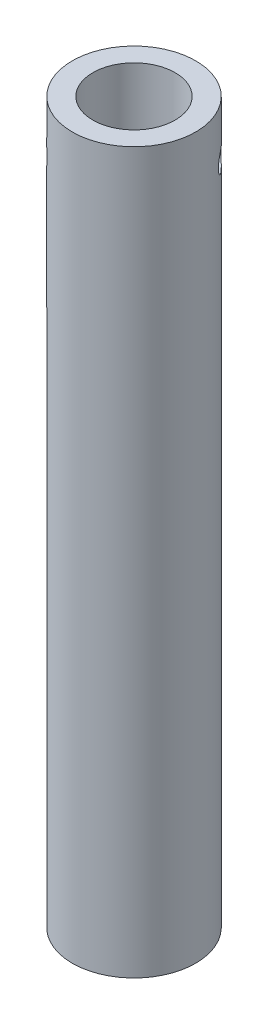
ISO-10303-21;
HEADER;
FILE_DESCRIPTION(('STEP AP214'),'2;1');
FILE_NAME('part.step','',(''),(''),'','','');
FILE_SCHEMA(('AUTOMOTIVE_DESIGN { 1 0 10303 214 1 1 1 1 }'));
ENDSEC;
DATA;
#1=APPLICATION_CONTEXT('core data for automotive mechanical design processes');
#2=APPLICATION_PROTOCOL_DEFINITION('international standard','automotive_design',2000,#1);
#3=PRODUCT_CONTEXT('',#1,'mechanical');
#4=PRODUCT('Part','Part','',(#3));
#5=PRODUCT_RELATED_PRODUCT_CATEGORY('part','',(#4));
#6=PRODUCT_DEFINITION_FORMATION('','',#4);
#7=PRODUCT_DEFINITION_CONTEXT('part definition',#1,'design');
#8=PRODUCT_DEFINITION('design','',#6,#7);
#9=PRODUCT_DEFINITION_SHAPE('','',#8);
#10=(LENGTH_UNIT() NAMED_UNIT(*) SI_UNIT(.MILLI.,.METRE.));
#11=(NAMED_UNIT(*) PLANE_ANGLE_UNIT() SI_UNIT($,.RADIAN.));
#12=(NAMED_UNIT(*) SI_UNIT($,.STERADIAN.) SOLID_ANGLE_UNIT());
#13=UNCERTAINTY_MEASURE_WITH_UNIT(LENGTH_MEASURE(1.E-05),#10,'distance_accuracy_value','');
#14=(GEOMETRIC_REPRESENTATION_CONTEXT(3) GLOBAL_UNCERTAINTY_ASSIGNED_CONTEXT((#13)) GLOBAL_UNIT_ASSIGNED_CONTEXT((#10,
#11,#12)) REPRESENTATION_CONTEXT('',''));
#15=CARTESIAN_POINT('',(0.,0.,0.));
#16=DIRECTION('',(0.,0.,1.));
#17=DIRECTION('',(1.,0.,0.));
#18=AXIS2_PLACEMENT_3D('',#15,#16,#17);
#19=CARTESIAN_POINT('',(0.,35.,0.));
#20=DIRECTION('',(0.,-1.,0.));
#21=DIRECTION('',(0.,0.,-1.));
#22=AXIS2_PLACEMENT_3D('',#19,#20,#21);
#23=CYLINDRICAL_SURFACE('',#22,3.);
#24=CARTESIAN_POINT('',(-2.59114600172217,32.5,1.51193994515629));
#25=CARTESIAN_POINT('',(-2.59114567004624,32.5278751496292,1.51194112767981));
#26=CARTESIAN_POINT('',(-2.58995274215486,32.555765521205,1.51399068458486));
#27=CARTESIAN_POINT('',(-2.5851891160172,32.610763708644,1.52210989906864));
#28=CARTESIAN_POINT('',(-2.58161622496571,32.6378707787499,1.52818326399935));
#29=CARTESIAN_POINT('',(-2.57212852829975,32.6904984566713,1.54409846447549));
#30=CARTESIAN_POINT('',(-2.56621567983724,32.7160203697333,1.55393715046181));
#31=CARTESIAN_POINT('',(-2.55210700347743,32.7647961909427,1.57700087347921));
#32=CARTESIAN_POINT('',(-2.5439114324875,32.7880503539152,1.5902255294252));
#33=CARTESIAN_POINT('',(-2.52524328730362,32.8318625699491,1.61970755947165));
#34=CARTESIAN_POINT('',(-2.51475126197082,32.8523950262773,1.63599066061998));
#35=CARTESIAN_POINT('',(-2.49166794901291,32.8899586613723,1.6709364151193));
#36=CARTESIAN_POINT('',(-2.47907653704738,32.9069896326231,1.68959920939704));
#37=CARTESIAN_POINT('',(-2.45190973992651,32.9371629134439,1.72878847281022));
#38=CARTESIAN_POINT('',(-2.43732295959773,32.9502814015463,1.74932540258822));
#39=CARTESIAN_POINT('',(-2.40650566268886,32.9721042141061,1.79148301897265));
#40=CARTESIAN_POINT('',(-2.39027525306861,32.980808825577,1.81310363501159));
#41=CARTESIAN_POINT('',(-2.3567020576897,32.9934785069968,1.85652938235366));
#42=CARTESIAN_POINT('',(-2.33937092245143,32.9974865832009,1.87833096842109));
#43=CARTESIAN_POINT('',(-2.30392122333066,33.0007831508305,1.92164772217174));
#44=CARTESIAN_POINT('',(-2.2858027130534,33.0000719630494,1.9431629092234));
#45=CARTESIAN_POINT('',(-2.24949283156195,32.9939837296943,1.98508025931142));
#46=CARTESIAN_POINT('',(-2.23130395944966,32.9886529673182,2.00549133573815));
#47=CARTESIAN_POINT('',(-2.19524362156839,32.9735497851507,2.04490080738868));
#48=CARTESIAN_POINT('',(-2.17737216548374,32.9637772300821,2.06389915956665));
#49=CARTESIAN_POINT('',(-2.14245524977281,32.9400218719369,2.10012426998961));
#50=CARTESIAN_POINT('',(-2.12541394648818,32.9260199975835,2.11734251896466));
#51=CARTESIAN_POINT('',(-2.092835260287,32.894217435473,2.14955021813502));
#52=CARTESIAN_POINT('',(-2.0772979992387,32.8764164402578,2.16453948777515));
#53=CARTESIAN_POINT('',(-2.04811522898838,32.8372642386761,2.19217553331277));
#54=CARTESIAN_POINT('',(-2.03449495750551,32.8158725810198,2.20479168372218));
#55=CARTESIAN_POINT('',(-2.00990641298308,32.7702825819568,2.22723015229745));
#56=CARTESIAN_POINT('',(-1.99893816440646,32.7460842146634,2.23705244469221));
#57=CARTESIAN_POINT('',(-1.98009828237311,32.6955216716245,2.25374580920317));
#58=CARTESIAN_POINT('',(-1.97223013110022,32.6691551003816,2.26061356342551));
#59=CARTESIAN_POINT('',(-1.95995541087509,32.6150301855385,2.27126428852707));
#60=CARTESIAN_POINT('',(-1.95554853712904,32.5872719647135,2.27504753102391));
#61=CARTESIAN_POINT('',(-1.95042858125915,32.5315067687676,2.27943847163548));
#62=CARTESIAN_POINT('',(-1.94967201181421,32.5035067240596,2.280083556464));
#63=CARTESIAN_POINT('',(-1.95176916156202,32.4477426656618,2.27828860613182));
#64=CARTESIAN_POINT('',(-1.95462274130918,32.4199786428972,2.27584869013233));
#65=CARTESIAN_POINT('',(-1.96378103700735,32.3656544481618,2.26795058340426));
#66=CARTESIAN_POINT('',(-1.97006380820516,32.3390877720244,2.26251158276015));
#67=CARTESIAN_POINT('',(-1.98579334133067,32.2877059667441,2.24871820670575));
#68=CARTESIAN_POINT('',(-1.99524029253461,32.2628909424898,2.24036365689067));
#69=CARTESIAN_POINT('',(-2.01700961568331,32.2154650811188,2.22078537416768));
#70=CARTESIAN_POINT('',(-2.02935770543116,32.1928766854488,2.20953588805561));
#71=CARTESIAN_POINT('',(-2.05639280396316,32.150777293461,2.18439660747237));
#72=CARTESIAN_POINT('',(-2.0710799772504,32.1312665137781,2.17050662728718));
#73=CARTESIAN_POINT('',(-2.10240631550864,32.0956696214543,2.14017918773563));
#74=CARTESIAN_POINT('',(-2.11906419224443,32.0796212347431,2.12371673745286));
#75=CARTESIAN_POINT('',(-2.15359996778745,32.051668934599,2.08868649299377));
#76=CARTESIAN_POINT('',(-2.17147782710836,32.0397648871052,2.07011876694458));
#77=CARTESIAN_POINT('',(-2.20775072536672,32.020497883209,2.03138794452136));
#78=CARTESIAN_POINT('',(-2.22614314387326,32.013115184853,2.01123222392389));
#79=CARTESIAN_POINT('',(-2.26291328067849,32.0030368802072,1.96976921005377));
#80=CARTESIAN_POINT('',(-2.28129100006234,32.0003408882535,1.94846201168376));
#81=CARTESIAN_POINT('',(-2.31724678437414,31.9997236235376,1.9055554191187));
#82=CARTESIAN_POINT('',(-2.33483183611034,32.0017449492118,1.88396268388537));
#83=CARTESIAN_POINT('',(-2.36895582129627,32.0103807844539,1.84087042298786));
#84=CARTESIAN_POINT('',(-2.38549476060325,32.0169952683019,1.81937089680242));
#85=CARTESIAN_POINT('',(-2.41711246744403,32.0346076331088,1.77715017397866));
#86=CARTESIAN_POINT('',(-2.43219283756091,32.0456006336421,1.75642813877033));
#87=CARTESIAN_POINT('',(-2.46060984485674,32.0716515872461,1.71639231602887));
#88=CARTESIAN_POINT('',(-2.47394639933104,32.0867097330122,1.69707859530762));
#89=CARTESIAN_POINT('',(-2.49879429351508,32.1206670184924,1.66027900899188));
#90=CARTESIAN_POINT('',(-2.51028296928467,32.1396081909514,1.64281662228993));
#91=CARTESIAN_POINT('',(-2.53108884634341,32.1807056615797,1.61057702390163));
#92=CARTESIAN_POINT('',(-2.54040553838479,32.2028627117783,1.5958004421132));
#93=CARTESIAN_POINT('',(-2.55681246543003,32.2499490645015,1.569380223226));
#94=CARTESIAN_POINT('',(-2.56388648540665,32.2748968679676,1.55775948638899));
#95=CARTESIAN_POINT('',(-2.57563799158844,32.3267218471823,1.53825216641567));
#96=CARTESIAN_POINT('',(-2.58031787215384,32.3535970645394,1.53036185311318));
#97=CARTESIAN_POINT('',(-2.5862324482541,32.4004807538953,1.52033683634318));
#98=CARTESIAN_POINT('',(-2.58807390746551,32.4202053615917,1.51719458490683));
#99=CARTESIAN_POINT('',(-2.59053079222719,32.4599506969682,1.51299573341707));
#100=CARTESIAN_POINT('',(-2.59114624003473,32.479971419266,1.51193909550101));
#101=CARTESIAN_POINT('',(-2.59114600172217,32.5,1.51193994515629));
#102=B_SPLINE_CURVE_WITH_KNOTS('',3,(#24,#25,#26,#27,#28,#29,#30,#31,#32,#33,#34,#35,#36,#37,
#38,#39,#40,#41,#42,#43,#44,#45,#46,#47,#48,#49,#50,#51,#52,#53,#54,#55,#56,#57,#58,#59,#60,#61,
#62,#63,#64,#65,#66,#67,#68,#69,#70,#71,#72,#73,#74,#75,#76,#77,#78,#79,#80,#81,#82,#83,#84,#85,
#86,#87,#88,#89,#90,#91,#92,#93,#94,#95,#96,#97,#98,#99,#100,#101),.UNSPECIFIED.,.T.,.F.,(4,2,2,
2,2,2,2,2,2,2,2,2,2,2,2,2,2,2,2,2,2,2,2,2,2,2,2,2,2,2,2,2,2,2,2,2,2,2,4),(0.,0.083552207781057,
0.167181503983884,0.250740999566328,0.334291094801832,0.418578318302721,0.502870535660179,
0.587665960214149,0.672455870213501,0.756463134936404,0.840464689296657,0.923634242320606,
1.00680632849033,1.09035920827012,1.17391885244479,1.25849224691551,1.3430664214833,
1.42773532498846,1.5123967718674,1.59604708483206,1.6796941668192,1.76281212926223,
1.84593506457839,1.92982468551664,2.01372020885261,2.098488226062,2.18325350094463,
2.26764596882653,2.35203149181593,2.43539555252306,2.51875914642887,2.60203007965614,
2.68530496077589,2.76953399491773,2.85378275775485,2.93862745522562,3.02338713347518,
3.08342134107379,3.1434544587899),.UNSPECIFIED.);
#103=CARTESIAN_POINT('',(-2.59114600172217,32.5,1.51193994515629));
#104=VERTEX_POINT('',#103);
#105=EDGE_CURVE('E36',#104,#104,#102,.T.);
#106=ORIENTED_EDGE('',*,*,#105,.T.);
#107=EDGE_LOOP('',(#106));
#108=FACE_BOUND('',#107,.T.);
#109=CARTESIAN_POINT('',(1.95026248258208,32.5,-2.27957808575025));
#110=CARTESIAN_POINT('',(1.95026358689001,32.4721248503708,-2.2795775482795));
#111=CARTESIAN_POINT('',(1.95206723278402,32.444234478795,-2.27803786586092));
#112=CARTESIAN_POINT('',(1.95920551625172,32.389236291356,-2.27190119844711));
#113=CARTESIAN_POINT('',(1.9645434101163,32.3621292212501,-2.26730139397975));
#114=CARTESIAN_POINT('',(1.97850900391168,32.3095015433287,-2.25512468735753));
#115=CARTESIAN_POINT('',(1.9871339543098,32.2839796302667,-2.24755027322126));
#116=CARTESIAN_POINT('',(2.00730820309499,32.2352038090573,-2.22955055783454));
#117=CARTESIAN_POINT('',(2.01885717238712,32.2119496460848,-2.21912557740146));
#118=CARTESIAN_POINT('',(2.04453257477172,32.1681374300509,-2.19549374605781));
#119=CARTESIAN_POINT('',(2.05868084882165,32.1476049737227,-2.18226316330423));
#120=CARTESIAN_POINT('',(2.08894392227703,32.1100413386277,-2.1533116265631));
#121=CARTESIAN_POINT('',(2.10505883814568,32.0930103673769,-2.13759052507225));
#122=CARTESIAN_POINT('',(2.13876818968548,32.0628370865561,-2.10386349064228));
#123=CARTESIAN_POINT('',(2.15637088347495,32.0497185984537,-2.08584447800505));
#124=CARTESIAN_POINT('',(2.19234914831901,32.0278957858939,-2.04799563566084));
#125=CARTESIAN_POINT('',(2.21072466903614,32.019191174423,-2.02816592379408));
#126=CARTESIAN_POINT('',(2.2474586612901,32.0065214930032,-1.98737905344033));
#127=CARTESIAN_POINT('',(2.26581572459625,32.0025134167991,-1.96643399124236));
#128=CARTESIAN_POINT('',(2.30210744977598,31.9992168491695,-1.92382022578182));
#129=CARTESIAN_POINT('',(2.32004214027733,31.9999280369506,-1.90215157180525));
#130=CARTESIAN_POINT('',(2.35480337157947,32.0060162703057,-1.85894128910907));
#131=CARTESIAN_POINT('',(2.37163912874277,32.0113470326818,-1.83740052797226));
#132=CARTESIAN_POINT('',(2.40397732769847,32.0264502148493,-1.79488352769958));
#133=CARTESIAN_POINT('',(2.41947972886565,32.0362227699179,-1.7739073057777));
#134=CARTESIAN_POINT('',(2.44888887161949,32.0599781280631,-1.73308388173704));
#135=CARTESIAN_POINT('',(2.46278798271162,32.0739800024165,-1.71324228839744));
#136=CARTESIAN_POINT('',(2.48866172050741,32.105782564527,-1.67543678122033));
#137=CARTESIAN_POINT('',(2.50063619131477,32.1235835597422,-1.65747301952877));
#138=CARTESIAN_POINT('',(2.52261802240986,32.1627357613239,-1.6238250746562));
#139=CARTESIAN_POINT('',(2.53259975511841,32.1841274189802,-1.60817119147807));
#140=CARTESIAN_POINT('',(2.55028775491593,32.2297174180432,-1.57997161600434));
#141=CARTESIAN_POINT('',(2.55799400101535,32.2539157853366,-1.56742595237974));
#142=CARTESIAN_POINT('',(2.57105554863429,32.3044783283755,-1.54590838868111));
#143=CARTESIAN_POINT('',(2.57640820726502,32.3308448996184,-1.53694050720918));
#144=CARTESIAN_POINT('',(2.58469632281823,32.3849698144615,-1.52296145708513));
#145=CARTESIAN_POINT('',(2.58763199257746,32.4127280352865,-1.51794994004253));
#146=CARTESIAN_POINT('',(2.59103828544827,32.4684932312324,-1.51212830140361));
#147=CARTESIAN_POINT('',(2.59153793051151,32.4964932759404,-1.51126871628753));
#148=CARTESIAN_POINT('',(2.5901462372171,32.5522573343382,-1.513652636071));
#149=CARTESIAN_POINT('',(2.58825499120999,32.5800213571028,-1.51689598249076));
#150=CARTESIAN_POINT('',(2.58211887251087,32.6343455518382,-1.52731723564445));
#151=CARTESIAN_POINT('',(2.57788896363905,32.6609122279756,-1.53447012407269));
#152=CARTESIAN_POINT('',(2.56712549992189,32.7122940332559,-1.55240955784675));
#153=CARTESIAN_POINT('',(2.56059180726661,32.7371090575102,-1.5631963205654));
#154=CARTESIAN_POINT('',(2.54521470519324,32.7845349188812,-1.58811132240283));
#155=CARTESIAN_POINT('',(2.53635054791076,32.8071233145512,-1.60226946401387));
#156=CARTESIAN_POINT('',(2.51644192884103,32.849222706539,-1.63335847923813));
#157=CARTESIAN_POINT('',(2.50539731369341,32.8687334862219,-1.65028954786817));
#158=CARTESIAN_POINT('',(2.48115003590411,32.9043303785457,-1.68652713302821));
#159=CARTESIAN_POINT('',(2.46792612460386,32.9203787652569,-1.70585652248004));
#160=CARTESIAN_POINT('',(2.43962460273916,32.948331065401,-1.74609160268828));
#161=CARTESIAN_POINT('',(2.42454705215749,32.9602351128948,-1.76699724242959));
#162=CARTESIAN_POINT('',(2.3929145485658,32.979502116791,-1.80960222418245));
#163=CARTESIAN_POINT('',(2.37636638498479,32.986884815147,-1.83129767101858));
#164=CARTESIAN_POINT('',(2.34213436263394,32.9969631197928,-1.87487969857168));
#165=CARTESIAN_POINT('',(2.32445059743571,32.9996591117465,-1.8967662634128));
#166=CARTESIAN_POINT('',(2.28865279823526,33.0002763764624,-1.93980475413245));
#167=CARTESIAN_POINT('',(2.2705465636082,32.9982550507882,-1.96096236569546));
#168=CARTESIAN_POINT('',(2.23423903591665,32.9896192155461,-2.00223163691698));
#169=CARTESIAN_POINT('',(2.216037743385,32.9830047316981,-2.0223433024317));
#170=CARTESIAN_POINT('',(2.18014028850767,32.9653923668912,-2.0609909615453));
#171=CARTESIAN_POINT('',(2.16244358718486,32.9543993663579,-2.07952868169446));
#172=CARTESIAN_POINT('',(2.12812448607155,32.928348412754,-2.11463698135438));
#173=CARTESIAN_POINT('',(2.11150213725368,32.9132902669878,-2.13120746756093));
#174=CARTESIAN_POINT('',(2.07973005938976,32.8793329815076,-2.16222621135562));
#175=CARTESIAN_POINT('',(2.06459938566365,32.8603918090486,-2.17664797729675));
#176=CARTESIAN_POINT('',(2.03659238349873,32.8192943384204,-2.2028755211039));
#177=CARTESIAN_POINT('',(2.02371658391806,32.7971372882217,-2.21468068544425));
#178=CARTESIAN_POINT('',(2.00065008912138,32.7500509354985,-2.23554098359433));
#179=CARTESIAN_POINT('',(1.99047903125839,32.7251031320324,-2.2445760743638));
#180=CARTESIAN_POINT('',(1.97338320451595,32.6732781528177,-2.25962154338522));
#181=CARTESIAN_POINT('',(1.9664551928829,32.6464029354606,-2.26563494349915));
#182=CARTESIAN_POINT('',(1.95764721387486,32.5995192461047,-2.27324432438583));
#183=CARTESIAN_POINT('',(1.95488421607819,32.5797946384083,-2.27561720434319));
#184=CARTESIAN_POINT('',(1.9511914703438,32.5400493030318,-2.27878426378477));
#185=CARTESIAN_POINT('',(1.95026168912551,32.520028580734,-2.27957847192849));
#186=CARTESIAN_POINT('',(1.95026248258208,32.5,-2.27957808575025));
#187=B_SPLINE_CURVE_WITH_KNOTS('',3,(#109,#110,#111,#112,#113,#114,#115,#116,#117,#118,#119,
#120,#121,#122,#123,#124,#125,#126,#127,#128,#129,#130,#131,#132,#133,#134,#135,#136,#137,#138,
#139,#140,#141,#142,#143,#144,#145,#146,#147,#148,#149,#150,#151,#152,#153,#154,#155,#156,#157,
#158,#159,#160,#161,#162,#163,#164,#165,#166,#167,#168,#169,#170,#171,#172,#173,#174,#175,#176,
#177,#178,#179,#180,#181,#182,#183,#184,#185,#186),.UNSPECIFIED.,.T.,.F.,(4,2,2,2,2,2,2,2,2,2,2,
2,2,2,2,2,2,2,2,2,2,2,2,2,2,2,2,2,2,2,2,2,2,2,2,2,2,2,4),(0.,0.083552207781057,
0.167181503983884,0.250740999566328,0.334291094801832,0.418578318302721,0.502870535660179,
0.587665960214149,0.672455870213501,0.756463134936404,0.840464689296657,0.923634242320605,
1.00680632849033,1.09035920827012,1.17391885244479,1.25849224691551,1.3430664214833,
1.42773532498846,1.5123967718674,1.59604708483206,1.6796941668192,1.76281212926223,
1.84593506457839,1.92982468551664,2.01372020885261,2.098488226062,2.18325350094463,
2.26764596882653,2.35203149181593,2.43539555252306,2.51875914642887,2.60203007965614,
2.68530496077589,2.76953399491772,2.85378275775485,2.93862745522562,3.02338713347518,
3.08342134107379,3.1434544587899),.UNSPECIFIED.);
#188=CARTESIAN_POINT('',(1.95026248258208,32.5,-2.27957808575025));
#189=VERTEX_POINT('',#188);
#190=EDGE_CURVE('E10',#189,#189,#187,.T.);
#191=ORIENTED_EDGE('',*,*,#190,.T.);
#192=EDGE_LOOP('',(#191));
#193=FACE_BOUND('',#192,.T.);
#194=CARTESIAN_POINT('',(0.,35.,0.));
#195=DIRECTION('',(0.,1.,0.));
#196=DIRECTION('',(0.,0.,1.));
#197=AXIS2_PLACEMENT_3D('',#194,#195,#196);
#198=CIRCLE('',#197,3.);
#199=CARTESIAN_POINT('',(0.,35.,3.));
#200=VERTEX_POINT('',#199);
#201=EDGE_CURVE('E43',#200,#200,#198,.T.);
#202=ORIENTED_EDGE('',*,*,#201,.F.);
#203=EDGE_LOOP('',(#202));
#204=FACE_BOUND('',#203,.T.);
#205=CARTESIAN_POINT('',(0.,0.,0.));
#206=DIRECTION('',(0.,1.,0.));
#207=DIRECTION('',(0.,0.,1.));
#208=AXIS2_PLACEMENT_3D('',#205,#206,#207);
#209=CIRCLE('',#208,3.);
#210=CARTESIAN_POINT('',(0.,0.,3.));
#211=VERTEX_POINT('',#210);
#212=EDGE_CURVE('E47',#211,#211,#209,.T.);
#213=ORIENTED_EDGE('',*,*,#212,.T.);
#214=EDGE_LOOP('',(#213));
#215=FACE_BOUND('',#214,.T.);
#216=ADVANCED_FACE('F32',(#108,#193,#204,#215),#23,.T.);
#217=CARTESIAN_POINT('',(0.,35.,0.));
#218=DIRECTION('',(0.,1.,0.));
#219=DIRECTION('',(0.,0.,1.));
#220=AXIS2_PLACEMENT_3D('',#217,#218,#219);
#221=PLANE('',#220);
#222=CARTESIAN_POINT('',(0.,35.,0.));
#223=DIRECTION('',(0.,1.,0.));
#224=DIRECTION('',(0.,0.,1.));
#225=AXIS2_PLACEMENT_3D('',#222,#223,#224);
#226=CIRCLE('',#225,2.);
#227=CARTESIAN_POINT('',(0.,35.,2.));
#228=VERTEX_POINT('',#227);
#229=EDGE_CURVE('E77',#228,#228,#226,.T.);
#230=ORIENTED_EDGE('',*,*,#229,.F.);
#231=EDGE_LOOP('',(#230));
#232=FACE_BOUND('',#231,.T.);
#233=ORIENTED_EDGE('',*,*,#201,.T.);
#234=EDGE_LOOP('',(#233));
#235=FACE_BOUND('',#234,.T.);
#236=ADVANCED_FACE('F95',(#232,#235),#221,.T.);
#237=CARTESIAN_POINT('',(0.,0.,0.));
#238=DIRECTION('',(0.,1.,0.));
#239=DIRECTION('',(0.,0.,1.));
#240=AXIS2_PLACEMENT_3D('',#237,#238,#239);
#241=PLANE('',#240);
#242=CARTESIAN_POINT('',(0.,0.,0.));
#243=DIRECTION('',(0.,1.,0.));
#244=DIRECTION('',(0.,0.,1.));
#245=AXIS2_PLACEMENT_3D('',#242,#243,#244);
#246=CIRCLE('',#245,2.);
#247=CARTESIAN_POINT('',(0.,0.,2.));
#248=VERTEX_POINT('',#247);
#249=EDGE_CURVE('E52',#248,#248,#246,.T.);
#250=ORIENTED_EDGE('',*,*,#249,.T.);
#251=EDGE_LOOP('',(#250));
#252=FACE_BOUND('',#251,.T.);
#253=ORIENTED_EDGE('',*,*,#212,.F.);
#254=EDGE_LOOP('',(#253));
#255=FACE_BOUND('',#254,.T.);
#256=ADVANCED_FACE('F85',(#252,#255),#241,.F.);
#257=CARTESIAN_POINT('',(0.,-22.55,0.));
#258=DIRECTION('',(0.,1.,0.));
#259=DIRECTION('',(0.,0.,1.));
#260=AXIS2_PLACEMENT_3D('',#257,#258,#259);
#261=CYLINDRICAL_SURFACE('',#260,2.);
#262=CARTESIAN_POINT('',(-1.80696662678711,32.5,0.857246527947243));
#263=CARTESIAN_POINT('',(-1.80696652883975,32.4723898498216,0.857247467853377));
#264=CARTESIAN_POINT('',(-1.8059541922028,32.4447710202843,0.859390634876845));
#265=CARTESIAN_POINT('',(-1.80189892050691,32.3903264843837,0.867860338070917));
#266=CARTESIAN_POINT('',(-1.79885480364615,32.36350124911,0.874189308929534));
#267=CARTESIAN_POINT('',(-1.79072742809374,32.3114392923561,0.89071845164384));
#268=CARTESIAN_POINT('',(-1.78564680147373,32.2862005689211,0.900913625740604));
#269=CARTESIAN_POINT('',(-1.77342985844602,32.2379378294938,0.924729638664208));
#270=CARTESIAN_POINT('',(-1.7662934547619,32.2149139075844,0.938350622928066));
#271=CARTESIAN_POINT('',(-1.74979223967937,32.1712276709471,0.968778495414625));
#272=CARTESIAN_POINT('',(-1.74038602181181,32.1506212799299,0.985643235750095));
#273=CARTESIAN_POINT('',(-1.71944274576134,32.1128477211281,1.02173936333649));
#274=CARTESIAN_POINT('',(-1.70790548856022,32.0956808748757,1.04097097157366));
#275=CARTESIAN_POINT('',(-1.68260260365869,32.0650449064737,1.08139915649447));
#276=CARTESIAN_POINT('',(-1.66880812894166,32.0516307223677,1.10261940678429));
#277=CARTESIAN_POINT('',(-1.63929323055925,32.0292380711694,1.14603917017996));
#278=CARTESIAN_POINT('',(-1.62357309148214,32.0202589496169,1.16823853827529));
#279=CARTESIAN_POINT('',(-1.59085827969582,32.0071704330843,1.21239820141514));
#280=CARTESIAN_POINT('',(-1.57389587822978,32.0029660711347,1.23435422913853));
#281=CARTESIAN_POINT('',(-1.53885880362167,31.9992483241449,1.2777680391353));
#282=CARTESIAN_POINT('',(-1.52078429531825,31.9997342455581,1.29922589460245));
#283=CARTESIAN_POINT('',(-1.48447872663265,32.00531497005,1.34054578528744));
#284=CARTESIAN_POINT('',(-1.46626003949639,32.0103072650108,1.36043266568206));
#285=CARTESIAN_POINT('',(-1.42986519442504,32.0245942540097,1.39863576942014));
#286=CARTESIAN_POINT('',(-1.41168903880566,32.0338891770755,1.41695190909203));
#287=CARTESIAN_POINT('',(-1.37583501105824,32.0566005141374,1.4517951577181));
#288=CARTESIAN_POINT('',(-1.35816312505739,32.0700534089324,1.46830460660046));
#289=CARTESIAN_POINT('',(-1.32412348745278,32.1006711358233,1.49907446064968));
#290=CARTESIAN_POINT('',(-1.30775596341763,32.1178366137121,1.51333447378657));
#291=CARTESIAN_POINT('',(-1.27652579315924,32.1559417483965,1.53977674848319));
#292=CARTESIAN_POINT('',(-1.26171586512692,32.1769709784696,1.55189233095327));
#293=CARTESIAN_POINT('',(-1.23475641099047,32.2219199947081,1.57342784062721));
#294=CARTESIAN_POINT('',(-1.22260700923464,32.2458399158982,1.58284764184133));
#295=CARTESIAN_POINT('',(-1.20148661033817,32.2960580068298,1.59893961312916));
#296=CARTESIAN_POINT('',(-1.1925313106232,32.3223671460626,1.60559823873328));
#297=CARTESIAN_POINT('',(-1.17835192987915,32.3765170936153,1.61603374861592));
#298=CARTESIAN_POINT('',(-1.1731270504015,32.4043575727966,1.61981124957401));
#299=CARTESIAN_POINT('',(-1.16678579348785,32.4599919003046,1.62438478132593));
#300=CARTESIAN_POINT('',(-1.16556454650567,32.4877675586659,1.62525692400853));
#301=CARTESIAN_POINT('',(-1.1670031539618,32.5431643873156,1.62422425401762));
#302=CARTESIAN_POINT('',(-1.16966265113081,32.5707855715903,1.62231969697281));
#303=CARTESIAN_POINT('',(-1.17864020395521,32.6246228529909,1.61580842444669));
#304=CARTESIAN_POINT('',(-1.18489768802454,32.6508545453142,1.61124643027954));
#305=CARTESIAN_POINT('',(-1.20070698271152,32.7016862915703,1.59949964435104));
#306=CARTESIAN_POINT('',(-1.21025918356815,32.7262861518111,1.59231454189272));
#307=CARTESIAN_POINT('',(-1.23243006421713,32.7736882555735,1.57521908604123));
#308=CARTESIAN_POINT('',(-1.24510522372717,32.7964457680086,1.56525803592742));
#309=CARTESIAN_POINT('',(-1.27286438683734,32.8390376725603,1.54276851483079));
#310=CARTESIAN_POINT('',(-1.28794878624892,32.85887158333,1.53023962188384));
#311=CARTESIAN_POINT('',(-1.32032060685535,32.8955622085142,1.50240460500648));
#312=CARTESIAN_POINT('',(-1.33765370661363,32.9123320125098,1.48703683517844));
#313=CARTESIAN_POINT('',(-1.37352536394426,32.9417871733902,1.45396776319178));
#314=CARTESIAN_POINT('',(-1.39206385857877,32.9544727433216,1.43626658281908));
#315=CARTESIAN_POINT('',(-1.42950654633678,32.9752892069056,1.3990006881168));
#316=CARTESIAN_POINT('',(-1.44840705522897,32.9834528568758,1.37945060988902));
#317=CARTESIAN_POINT('',(-1.48602601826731,32.9950920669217,1.33883976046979));
#318=CARTESIAN_POINT('',(-1.50474450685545,32.9985685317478,1.31777928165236));
#319=CARTESIAN_POINT('',(-1.54088170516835,33.0006837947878,1.27531954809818));
#320=CARTESIAN_POINT('',(-1.55832187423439,32.9994508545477,1.25394485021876));
#321=CARTESIAN_POINT('',(-1.59195812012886,32.9924760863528,1.21095595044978));
#322=CARTESIAN_POINT('',(-1.60815423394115,32.9867343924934,1.18934175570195));
#323=CARTESIAN_POINT('',(-1.63885190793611,32.9709738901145,1.146670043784));
#324=CARTESIAN_POINT('',(-1.65336212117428,32.9609782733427,1.12561015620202));
#325=CARTESIAN_POINT('',(-1.68055124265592,32.9370147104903,1.08459835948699));
#326=CARTESIAN_POINT('',(-1.69322991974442,32.9230462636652,1.0646465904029));
#327=CARTESIAN_POINT('',(-1.7169018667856,32.8911423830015,1.02604743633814));
#328=CARTESIAN_POINT('',(-1.72784748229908,32.8731199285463,1.00744275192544));
#329=CARTESIAN_POINT('',(-1.74761968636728,32.8337885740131,0.972741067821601));
#330=CARTESIAN_POINT('',(-1.75644573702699,32.812478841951,0.95664470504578));
#331=CARTESIAN_POINT('',(-1.77211255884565,32.7666992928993,0.927307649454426));
#332=CARTESIAN_POINT('',(-1.7789132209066,32.7421779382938,0.914125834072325));
#333=CARTESIAN_POINT('',(-1.79031435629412,32.6909722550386,0.891591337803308));
#334=CARTESIAN_POINT('',(-1.79491643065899,32.6642895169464,0.882235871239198));
#335=CARTESIAN_POINT('',(-1.8012790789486,32.6147114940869,0.869157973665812));
#336=CARTESIAN_POINT('',(-1.80341228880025,32.5920534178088,0.864705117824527));
#337=CARTESIAN_POINT('',(-1.80625604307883,32.5462655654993,0.858749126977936));
#338=CARTESIAN_POINT('',(-1.80696670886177,32.5231358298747,0.857245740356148));
#339=CARTESIAN_POINT('',(-1.80696662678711,32.5,0.857246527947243));
#340=B_SPLINE_CURVE_WITH_KNOTS('',3,(#262,#263,#264,#265,#266,#267,#268,#269,#270,#271,#272,
#273,#274,#275,#276,#277,#278,#279,#280,#281,#282,#283,#284,#285,#286,#287,#288,#289,#290,#291,
#292,#293,#294,#295,#296,#297,#298,#299,#300,#301,#302,#303,#304,#305,#306,#307,#308,#309,#310,
#311,#312,#313,#314,#315,#316,#317,#318,#319,#320,#321,#322,#323,#324,#325,#326,#327,#328,#329,
#330,#331,#332,#333,#334,#335,#336,#337,#338,#339),.UNSPECIFIED.,.T.,.F.,(4,2,2,2,2,2,2,2,2,2,2,
2,2,2,2,2,2,2,2,2,2,2,2,2,2,2,2,2,2,2,2,2,2,2,2,2,2,2,4),(0.,0.0827454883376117,
0.165539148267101,0.248226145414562,0.330916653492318,0.415247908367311,0.499587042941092,
0.585102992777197,0.670606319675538,0.754377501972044,0.838136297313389,0.92003652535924,
1.00194111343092,1.08458574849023,1.16724477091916,1.25214093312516,1.33704106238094,
1.42235286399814,1.50764640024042,1.59068714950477,1.67372025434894,1.75539480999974,
1.83707904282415,1.92036569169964,2.00366603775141,2.08905066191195,2.17443083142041,
2.25918414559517,2.34392109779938,2.42636689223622,2.50881023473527,2.59080975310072,
2.67281961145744,2.75679419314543,2.84079006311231,2.92635295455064,3.01185344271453,
3.08119565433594,3.15053195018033),.UNSPECIFIED.);
#341=CARTESIAN_POINT('',(-1.80696662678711,32.5,0.857246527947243));
#342=VERTEX_POINT('',#341);
#343=EDGE_CURVE('E72',#342,#342,#340,.T.);
#344=ORIENTED_EDGE('',*,*,#343,.T.);
#345=EDGE_LOOP('',(#344));
#346=FACE_BOUND('',#345,.T.);
#347=CARTESIAN_POINT('',(1.16608310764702,32.5,-1.62488466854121));
#348=CARTESIAN_POINT('',(1.16608401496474,32.5276101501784,-1.62488440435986));
#349=CARTESIAN_POINT('',(1.16801200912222,32.5552289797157,-1.623505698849));
#350=CARTESIAN_POINT('',(1.17562161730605,32.6096735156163,-1.6180034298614));
#351=CARTESIAN_POINT('',(1.181305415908,32.63649875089,-1.61387826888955));
#352=CARTESIAN_POINT('',(1.19611795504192,32.6885607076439,-1.60293041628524));
#353=CARTESIAN_POINT('',(1.20524224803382,32.7137994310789,-1.59611120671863));
#354=CARTESIAN_POINT('',(1.22649444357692,32.7620621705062,-1.57983851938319));
#355=CARTESIAN_POINT('',(1.2386224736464,32.7850860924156,-1.57038492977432));
#356=CARTESIAN_POINT('',(1.26561539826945,32.8287723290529,-1.54871634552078));
#357=CARTESIAN_POINT('',(1.28052982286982,32.8493787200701,-1.53645028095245));
#358=CARTESIAN_POINT('',(1.31230686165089,32.8871522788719,-1.5093990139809));
#359=CARTESIAN_POINT('',(1.32916965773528,32.9043191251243,-1.49461357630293));
#360=CARTESIAN_POINT('',(1.36443080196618,32.9349550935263,-1.4624993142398));
#361=CARTESIAN_POINT('',(1.38284729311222,32.9483692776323,-1.44513787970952));
#362=CARTESIAN_POINT('',(1.4202999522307,32.9707619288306,-1.40834517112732));
#363=CARTESIAN_POINT('',(1.43933602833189,32.9797410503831,-1.38891420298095));
#364=CARTESIAN_POINT('',(1.47694539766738,32.9928295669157,-1.34884089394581));
#365=CARTESIAN_POINT('',(1.49552025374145,32.9970339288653,-1.32823106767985));
#366=CARTESIAN_POINT('',(1.53198114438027,33.0007516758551,-1.28600596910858));
#367=CARTESIAN_POINT('',(1.54986728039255,33.0002657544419,-1.26439084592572));
#368=CARTESIAN_POINT('',(1.58404142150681,32.99468502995,-1.22129147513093));
#369=CARTESIAN_POINT('',(1.60035608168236,32.9896927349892,-1.19981496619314));
#370=CARTESIAN_POINT('',(1.63144757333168,32.9754057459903,-1.15718421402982));
#371=CARTESIAN_POINT('',(1.64622432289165,32.9661108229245,-1.13602998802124));
#372=CARTESIAN_POINT('',(1.67410649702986,32.9433994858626,-1.094531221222));
#373=CARTESIAN_POINT('',(1.68719561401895,32.9299465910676,-1.07419572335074));
#374=CARTESIAN_POINT('',(1.71139377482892,32.8993288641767,-1.03520944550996));
#375=CARTESIAN_POINT('',(1.72250247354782,32.8821633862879,-1.01655895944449));
#376=CARTESIAN_POINT('',(1.74294417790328,32.8440582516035,-0.981109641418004));
#377=CARTESIAN_POINT('',(1.75222098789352,32.8230290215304,-0.964374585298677));
#378=CARTESIAN_POINT('',(1.76859724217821,32.7780800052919,-0.934003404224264));
#379=CARTESIAN_POINT('',(1.77569658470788,32.7541600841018,-0.920367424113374));
#380=CARTESIAN_POINT('',(1.78775924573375,32.7039419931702,-0.896713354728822));
#381=CARTESIAN_POINT('',(1.79271203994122,32.6776328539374,-0.886713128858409));
#382=CARTESIAN_POINT('',(1.80044834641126,32.6234829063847,-0.870898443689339));
#383=CARTESIAN_POINT('',(1.80323232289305,32.5956424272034,-0.865083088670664));
#384=CARTESIAN_POINT('',(1.8066002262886,32.5400080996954,-0.858027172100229));
#385=CARTESIAN_POINT('',(1.80724031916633,32.5122324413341,-0.856669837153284));
#386=CARTESIAN_POINT('',(1.80648108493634,32.4568356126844,-0.858269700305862));
#387=CARTESIAN_POINT('',(1.80508194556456,32.4292144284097,-0.861226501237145));
#388=CARTESIAN_POINT('',(1.80027810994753,32.3753771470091,-0.871222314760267));
#389=CARTESIAN_POINT('',(1.79690660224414,32.3491454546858,-0.878193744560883));
#390=CARTESIAN_POINT('',(1.78817108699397,32.2983137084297,-0.895846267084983));
#391=CARTESIAN_POINT('',(1.78280684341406,32.2737138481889,-0.906527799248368));
#392=CARTESIAN_POINT('',(1.76994437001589,32.2263117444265,-0.931394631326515));
#393=CARTESIAN_POINT('',(1.76240634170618,32.2035542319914,-0.945644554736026));
#394=CARTESIAN_POINT('',(1.7452341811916,32.1609623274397,-0.976972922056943));
#395=CARTESIAN_POINT('',(1.73559970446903,32.14112841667,-0.994051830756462));
#396=CARTESIAN_POINT('',(1.7139914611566,32.1044377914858,-1.03087311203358));
#397=CARTESIAN_POINT('',(1.70196519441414,32.0876679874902,-1.05067143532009));
#398=CARTESIAN_POINT('',(1.67583183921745,32.0582128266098,-1.09187079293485));
#399=CARTESIAN_POINT('',(1.66172485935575,32.0455272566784,-1.11327174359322));
#400=CARTESIAN_POINT('',(1.63174259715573,32.0247107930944,-1.15676617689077));
#401=CARTESIAN_POINT('',(1.61588105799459,32.0165471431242,-1.17885342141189));
#402=CARTESIAN_POINT('',(1.58263905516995,32.0049079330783,-1.22311849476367));
#403=CARTESIAN_POINT('',(1.56525888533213,32.0014314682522,-1.24529630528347));
#404=CARTESIAN_POINT('',(1.52993315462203,31.9993162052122,-1.28843351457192));
#405=CARTESIAN_POINT('',(1.51201558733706,32.0005491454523,-1.30940964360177));
#406=CARTESIAN_POINT('',(1.47572268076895,32.0075239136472,-1.35018055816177));
#407=CARTESIAN_POINT('',(1.45734735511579,32.0132656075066,-1.36997537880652));
#408=CARTESIAN_POINT('',(1.42084189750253,32.0290261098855,-1.40779830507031));
#409=CARTESIAN_POINT('',(1.40271097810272,32.0390217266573,-1.42583534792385));
#410=CARTESIAN_POINT('',(1.3672123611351,32.0629852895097,-1.45990973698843));
#411=CARTESIAN_POINT('',(1.34984476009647,32.0769537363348,-1.47594683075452));
#412=CARTESIAN_POINT('',(1.31609207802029,32.1088576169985,-1.50612980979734));
#413=CARTESIAN_POINT('',(1.29974050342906,32.1268800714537,-1.52022118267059));
#414=CARTESIAN_POINT('',(1.26912642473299,32.1662114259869,-1.54587123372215));
#415=CARTESIAN_POINT('',(1.25486445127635,32.187521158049,-1.55742926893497));
#416=CARTESIAN_POINT('',(1.2287958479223,32.2333007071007,-1.57808211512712));
#417=CARTESIAN_POINT('',(1.21703998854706,32.2578220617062,-1.58712694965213));
#418=CARTESIAN_POINT('',(1.19690306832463,32.3090277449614,-1.60236813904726));
#419=CARTESIAN_POINT('',(1.18851955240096,32.3357104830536,-1.60856656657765));
#420=CARTESIAN_POINT('',(1.17678773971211,32.3852885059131,-1.61716187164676));
#421=CARTESIAN_POINT('',(1.17278728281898,32.4079465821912,-1.62005580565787));
#422=CARTESIAN_POINT('',(1.16743469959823,32.4537344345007,-1.62391723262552));
#423=CARTESIAN_POINT('',(1.16608234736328,32.4768641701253,-1.62488488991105));
#424=CARTESIAN_POINT('',(1.16608310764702,32.5,-1.62488466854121));
#425=B_SPLINE_CURVE_WITH_KNOTS('',3,(#347,#348,#349,#350,#351,#352,#353,#354,#355,#356,#357,
#358,#359,#360,#361,#362,#363,#364,#365,#366,#367,#368,#369,#370,#371,#372,#373,#374,#375,#376,
#377,#378,#379,#380,#381,#382,#383,#384,#385,#386,#387,#388,#389,#390,#391,#392,#393,#394,#395,
#396,#397,#398,#399,#400,#401,#402,#403,#404,#405,#406,#407,#408,#409,#410,#411,#412,#413,#414,
#415,#416,#417,#418,#419,#420,#421,#422,#423,#424),.UNSPECIFIED.,.T.,.F.,(4,2,2,2,2,2,2,2,2,2,2,
2,2,2,2,2,2,2,2,2,2,2,2,2,2,2,2,2,2,2,2,2,2,2,2,2,2,2,4),(0.,0.0827454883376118,
0.165539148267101,0.248226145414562,0.330916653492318,0.415247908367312,0.499587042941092,
0.585102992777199,0.670606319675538,0.754377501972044,0.838136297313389,0.92003652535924,
1.00194111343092,1.08458574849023,1.16724477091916,1.25214093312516,1.33704106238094,
1.42235286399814,1.50764640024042,1.59068714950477,1.67372025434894,1.75539480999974,
1.83707904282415,1.92036569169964,2.00366603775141,2.08905066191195,2.17443083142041,
2.25918414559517,2.34392109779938,2.42636689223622,2.50881023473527,2.59080975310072,
2.67281961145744,2.75679419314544,2.84079006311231,2.92635295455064,3.01185344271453,
3.08119565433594,3.15053195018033),.UNSPECIFIED.);
#426=CARTESIAN_POINT('',(1.16608310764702,32.5,-1.62488466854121));
#427=VERTEX_POINT('',#426);
#428=EDGE_CURVE('E68',#427,#427,#425,.T.);
#429=ORIENTED_EDGE('',*,*,#428,.T.);
#430=EDGE_LOOP('',(#429));
#431=FACE_BOUND('',#430,.T.);
#432=ORIENTED_EDGE('',*,*,#229,.T.);
#433=EDGE_LOOP('',(#432));
#434=FACE_BOUND('',#433,.T.);
#435=ORIENTED_EDGE('',*,*,#249,.F.);
#436=EDGE_LOOP('',(#435));
#437=FACE_BOUND('',#436,.T.);
#438=ADVANCED_FACE('F60',(#346,#431,#434,#437),#261,.F.);
#439=CARTESIAN_POINT('',(2.30291442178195,32.5,-1.92265055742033));
#440=DIRECTION('',(0.767638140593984,0.,-0.640883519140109));
#441=DIRECTION('',(-0.640883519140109,0.,-0.767638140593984));
#442=AXIS2_PLACEMENT_3D('',#439,#440,#441);
#443=CYLINDRICAL_SURFACE('',#442,0.499999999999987);
#444=ORIENTED_EDGE('',*,*,#190,.F.);
#445=EDGE_LOOP('',(#444));
#446=FACE_BOUND('',#445,.T.);
#447=ORIENTED_EDGE('',*,*,#428,.F.);
#448=EDGE_LOOP('',(#447));
#449=FACE_BOUND('',#448,.T.);
#450=ADVANCED_FACE('F58',(#446,#449),#443,.F.);
#451=ORIENTED_EDGE('',*,*,#105,.F.);
#452=EDGE_LOOP('',(#451));
#453=FACE_BOUND('',#452,.T.);
#454=ORIENTED_EDGE('',*,*,#343,.F.);
#455=EDGE_LOOP('',(#454));
#456=FACE_BOUND('',#455,.T.);
#457=ADVANCED_FACE('F54',(#453,#456),#443,.F.);
#458=CLOSED_SHELL('',(#216,#236,#256,#438,#450,#457));
#459=MANIFOLD_SOLID_BREP('B2',#458);
#460=ADVANCED_BREP_SHAPE_REPRESENTATION('',(#18,#459),#14);
#461=SHAPE_DEFINITION_REPRESENTATION(#9,#460);
ENDSEC;
END-ISO-10303-21;
